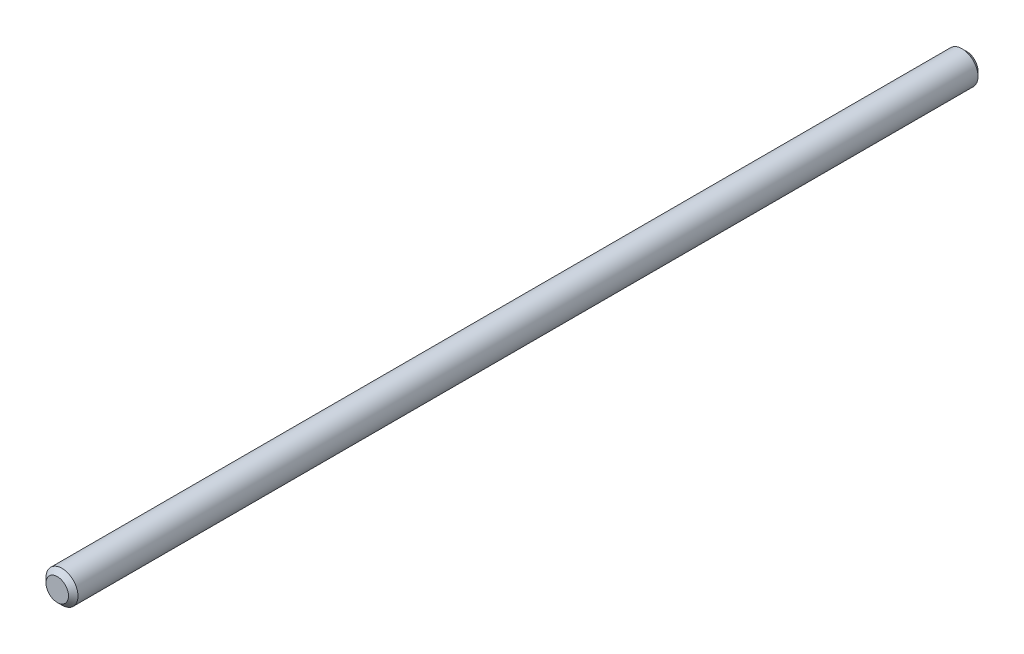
ISO-10303-21;
HEADER;
FILE_DESCRIPTION(('STEP AP214'),'2;1');
FILE_NAME('part.step','',(''),(''),'','','');
FILE_SCHEMA(('AUTOMOTIVE_DESIGN { 1 0 10303 214 1 1 1 1 }'));
ENDSEC;
DATA;
#1=APPLICATION_CONTEXT('core data for automotive mechanical design processes');
#2=APPLICATION_PROTOCOL_DEFINITION('international standard','automotive_design',2000,#1);
#3=PRODUCT_CONTEXT('',#1,'mechanical');
#4=PRODUCT('Part','Part','',(#3));
#5=PRODUCT_RELATED_PRODUCT_CATEGORY('part','',(#4));
#6=PRODUCT_DEFINITION_FORMATION('','',#4);
#7=PRODUCT_DEFINITION_CONTEXT('part definition',#1,'design');
#8=PRODUCT_DEFINITION('design','',#6,#7);
#9=PRODUCT_DEFINITION_SHAPE('','',#8);
#10=(LENGTH_UNIT() NAMED_UNIT(*) SI_UNIT(.MILLI.,.METRE.));
#11=(NAMED_UNIT(*) PLANE_ANGLE_UNIT() SI_UNIT($,.RADIAN.));
#12=(NAMED_UNIT(*) SI_UNIT($,.STERADIAN.) SOLID_ANGLE_UNIT());
#13=UNCERTAINTY_MEASURE_WITH_UNIT(LENGTH_MEASURE(1.E-05),#10,'distance_accuracy_value','');
#14=(GEOMETRIC_REPRESENTATION_CONTEXT(3) GLOBAL_UNCERTAINTY_ASSIGNED_CONTEXT((#13)) GLOBAL_UNIT_ASSIGNED_CONTEXT((#10,
#11,#12)) REPRESENTATION_CONTEXT('',''));
#15=CARTESIAN_POINT('',(0.,0.,0.));
#16=DIRECTION('',(0.,0.,1.));
#17=DIRECTION('',(1.,0.,0.));
#18=AXIS2_PLACEMENT_3D('',#15,#16,#17);
#19=CARTESIAN_POINT('',(0.,0.,0.));
#20=DIRECTION('',(0.,0.,1.));
#21=DIRECTION('',(0.999999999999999,0.,0.));
#22=AXIS2_PLACEMENT_3D('',#19,#20,#21);
#23=PLANE('',#22);
#24=CARTESIAN_POINT('',(0.,0.,0.));
#25=DIRECTION('',(0.,0.,1.));
#26=DIRECTION('',(0.999999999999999,0.,0.));
#27=AXIS2_PLACEMENT_3D('',#24,#25,#26);
#28=CIRCLE('',#27,3.77063);
#29=CARTESIAN_POINT('',(3.77062999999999,0.,0.));
#30=VERTEX_POINT('',#29);
#31=EDGE_CURVE('E10',#30,#30,#28,.F.);
#32=ORIENTED_EDGE('',*,*,#31,.T.);
#33=EDGE_LOOP('',(#32));
#34=FACE_BOUND('',#33,.T.);
#35=ADVANCED_FACE('F35',(#34),#23,.F.);
#36=CARTESIAN_POINT('',(0.,0.,0.));
#37=DIRECTION('',(0.,0.,1.));
#38=DIRECTION('',(0.999999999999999,0.,0.));
#39=AXIS2_PLACEMENT_3D('',#36,#37,#38);
#40=CYLINDRICAL_SURFACE('',#39,5.35812999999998);
#41=CARTESIAN_POINT('',(0.,0.,303.2125));
#42=DIRECTION('',(0.,0.,-1.));
#43=DIRECTION('',(-0.999999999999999,0.,0.));
#44=AXIS2_PLACEMENT_3D('',#41,#42,#43);
#45=CIRCLE('',#44,5.35812999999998);
#46=CARTESIAN_POINT('',(-5.35812999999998,0.,303.2125));
#47=VERTEX_POINT('',#46);
#48=EDGE_CURVE('E42',#47,#47,#45,.T.);
#49=ORIENTED_EDGE('',*,*,#48,.T.);
#50=EDGE_LOOP('',(#49));
#51=FACE_BOUND('',#50,.T.);
#52=CARTESIAN_POINT('',(0.,0.,1.58750000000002));
#53=DIRECTION('',(0.,0.,1.));
#54=DIRECTION('',(0.999999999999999,0.,0.));
#55=AXIS2_PLACEMENT_3D('',#52,#53,#54);
#56=CIRCLE('',#55,5.35812999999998);
#57=CARTESIAN_POINT('',(5.35812999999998,0.,1.58750000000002));
#58=VERTEX_POINT('',#57);
#59=EDGE_CURVE('E46',#58,#58,#56,.T.);
#60=ORIENTED_EDGE('',*,*,#59,.T.);
#61=EDGE_LOOP('',(#60));
#62=FACE_BOUND('',#61,.T.);
#63=ADVANCED_FACE('F66',(#51,#62),#40,.T.);
#64=CARTESIAN_POINT('',(0.,5.35812999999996,304.8));
#65=DIRECTION('',(0.,0.,-1.));
#66=DIRECTION('',(-0.999999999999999,0.,0.));
#67=AXIS2_PLACEMENT_3D('',#64,#65,#66);
#68=PLANE('',#67);
#69=CARTESIAN_POINT('',(0.,0.,304.8));
#70=DIRECTION('',(0.,0.,-1.));
#71=DIRECTION('',(-0.999999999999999,0.,0.));
#72=AXIS2_PLACEMENT_3D('',#69,#70,#71);
#73=CIRCLE('',#72,3.77062999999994);
#74=CARTESIAN_POINT('',(-3.77062999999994,0.,304.8));
#75=VERTEX_POINT('',#74);
#76=EDGE_CURVE('E50',#75,#75,#73,.F.);
#77=ORIENTED_EDGE('',*,*,#76,.T.);
#78=EDGE_LOOP('',(#77));
#79=FACE_BOUND('',#78,.T.);
#80=ADVANCED_FACE('F56',(#79),#68,.F.);
#81=CARTESIAN_POINT('',(0.,0.,304.8));
#82=DIRECTION('',(0.,0.,-1.));
#83=DIRECTION('',(-0.999999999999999,0.,0.));
#84=AXIS2_PLACEMENT_3D('',#81,#82,#83);
#85=CONICAL_SURFACE('',#84,3.77062999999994,0.785398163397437);
#86=ORIENTED_EDGE('',*,*,#48,.F.);
#87=EDGE_LOOP('',(#86));
#88=FACE_BOUND('',#87,.T.);
#89=ORIENTED_EDGE('',*,*,#76,.F.);
#90=EDGE_LOOP('',(#89));
#91=FACE_BOUND('',#90,.T.);
#92=ADVANCED_FACE('F58',(#88,#91),#85,.T.);
#93=CARTESIAN_POINT('',(0.,0.,1.58750000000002));
#94=DIRECTION('',(0.,0.,1.));
#95=DIRECTION('',(0.999999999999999,0.,0.));
#96=AXIS2_PLACEMENT_3D('',#93,#94,#95);
#97=CONICAL_SURFACE('',#96,5.35812999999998,0.785398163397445);
#98=ORIENTED_EDGE('',*,*,#31,.F.);
#99=EDGE_LOOP('',(#98));
#100=FACE_BOUND('',#99,.T.);
#101=ORIENTED_EDGE('',*,*,#59,.F.);
#102=EDGE_LOOP('',(#101));
#103=FACE_BOUND('',#102,.T.);
#104=ADVANCED_FACE('F37',(#100,#103),#97,.T.);
#105=CLOSED_SHELL('',(#35,#63,#80,#92,#104));
#106=MANIFOLD_SOLID_BREP('B2',#105);
#107=ADVANCED_BREP_SHAPE_REPRESENTATION('',(#18,#106),#14);
#108=SHAPE_DEFINITION_REPRESENTATION(#9,#107);
ENDSEC;
END-ISO-10303-21;
